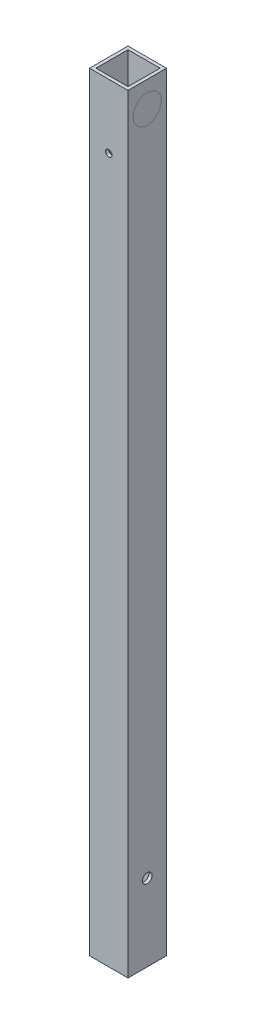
ISO-10303-21;
HEADER;
FILE_DESCRIPTION(('STEP AP214'),'2;1');
FILE_NAME('part.step','',(''),(''),'','','');
FILE_SCHEMA(('AUTOMOTIVE_DESIGN { 1 0 10303 214 1 1 1 1 }'));
ENDSEC;
DATA;
#1=APPLICATION_CONTEXT('core data for automotive mechanical design processes');
#2=APPLICATION_PROTOCOL_DEFINITION('international standard','automotive_design',2000,#1);
#3=PRODUCT_CONTEXT('',#1,'mechanical');
#4=PRODUCT('Part','Part','',(#3));
#5=PRODUCT_RELATED_PRODUCT_CATEGORY('part','',(#4));
#6=PRODUCT_DEFINITION_FORMATION('','',#4);
#7=PRODUCT_DEFINITION_CONTEXT('part definition',#1,'design');
#8=PRODUCT_DEFINITION('design','',#6,#7);
#9=PRODUCT_DEFINITION_SHAPE('','',#8);
#10=(LENGTH_UNIT() NAMED_UNIT(*) SI_UNIT(.MILLI.,.METRE.));
#11=(NAMED_UNIT(*) PLANE_ANGLE_UNIT() SI_UNIT($,.RADIAN.));
#12=(NAMED_UNIT(*) SI_UNIT($,.STERADIAN.) SOLID_ANGLE_UNIT());
#13=UNCERTAINTY_MEASURE_WITH_UNIT(LENGTH_MEASURE(1.E-05),#10,'distance_accuracy_value','');
#14=(GEOMETRIC_REPRESENTATION_CONTEXT(3) GLOBAL_UNCERTAINTY_ASSIGNED_CONTEXT((#13)) GLOBAL_UNIT_ASSIGNED_CONTEXT((#10,
#11,#12)) REPRESENTATION_CONTEXT('',''));
#15=CARTESIAN_POINT('',(0.,0.,0.));
#16=DIRECTION('',(0.,0.,1.));
#17=DIRECTION('',(1.,0.,0.));
#18=AXIS2_PLACEMENT_3D('',#15,#16,#17);
#19=CARTESIAN_POINT('',(19.05,762.,19.05));
#20=DIRECTION('',(-1.,0.,0.));
#21=DIRECTION('',(0.,0.,1.));
#22=AXIS2_PLACEMENT_3D('',#19,#20,#21);
#23=PLANE('',#22);
#24=DIRECTION('',(0.,0.,-1.));
#25=VECTOR('',#24,1.);
#26=CARTESIAN_POINT('',(19.05,0.,19.05));
#27=LINE('',#26,#25);
#28=CARTESIAN_POINT('',(19.05,0.,19.05));
#29=VERTEX_POINT('',#28);
#30=CARTESIAN_POINT('',(19.05,0.,-19.05));
#31=VERTEX_POINT('',#30);
#32=EDGE_CURVE('E120',#29,#31,#27,.T.);
#33=ORIENTED_EDGE('',*,*,#32,.T.);
#34=DIRECTION('',(0.,-1.,0.));
#35=VECTOR('',#34,1.);
#36=CARTESIAN_POINT('',(19.05,762.,-19.05));
#37=LINE('',#36,#35);
#38=CARTESIAN_POINT('',(19.05,762.,-19.05));
#39=VERTEX_POINT('',#38);
#40=EDGE_CURVE('E47',#39,#31,#37,.T.);
#41=ORIENTED_EDGE('',*,*,#40,.F.);
#42=DIRECTION('',(0.,0.,-1.));
#43=VECTOR('',#42,1.);
#44=CARTESIAN_POINT('',(19.05,762.,19.05));
#45=LINE('',#44,#43);
#46=CARTESIAN_POINT('',(19.05,762.,19.05));
#47=VERTEX_POINT('',#46);
#48=EDGE_CURVE('E143',#47,#39,#45,.T.);
#49=ORIENTED_EDGE('',*,*,#48,.F.);
#50=DIRECTION('',(0.,-1.,0.));
#51=VECTOR('',#50,1.);
#52=CARTESIAN_POINT('',(19.05,762.,19.05));
#53=LINE('',#52,#51);
#54=EDGE_CURVE('E153',#47,#29,#53,.T.);
#55=ORIENTED_EDGE('',*,*,#54,.T.);
#56=EDGE_LOOP('',(#33,#41,#49,#55));
#57=FACE_BOUND('',#56,.T.);
#58=CARTESIAN_POINT('',(19.05,76.2,0.));
#59=DIRECTION('',(-1.,0.,0.));
#60=DIRECTION('',(0.,0.,1.));
#61=AXIS2_PLACEMENT_3D('',#58,#59,#60);
#62=CIRCLE('',#61,4.7625);
#63=CARTESIAN_POINT('',(19.05,76.2,4.7625));
#64=VERTEX_POINT('',#63);
#65=EDGE_CURVE('E173',#64,#64,#62,.T.);
#66=ORIENTED_EDGE('',*,*,#65,.T.);
#67=EDGE_LOOP('',(#66));
#68=FACE_BOUND('',#67,.T.);
#69=CARTESIAN_POINT('',(19.05,736.6,0.));
#70=DIRECTION('',(-1.,0.,0.));
#71=DIRECTION('',(0.,0.,1.));
#72=AXIS2_PLACEMENT_3D('',#69,#70,#71);
#73=CIRCLE('',#72,13.97);
#74=CARTESIAN_POINT('',(19.05,736.6,13.97));
#75=VERTEX_POINT('',#74);
#76=EDGE_CURVE('E11',#75,#75,#73,.F.);
#77=ORIENTED_EDGE('',*,*,#76,.F.);
#78=EDGE_LOOP('',(#77));
#79=FACE_BOUND('',#78,.T.);
#80=ADVANCED_FACE('F37',(#57,#68,#79),#23,.F.);
#81=CARTESIAN_POINT('',(0.,762.,0.));
#82=DIRECTION('',(0.,-1.,0.));
#83=DIRECTION('',(0.,0.,-1.));
#84=AXIS2_PLACEMENT_3D('',#81,#82,#83);
#85=PLANE('',#84);
#86=ORIENTED_EDGE('',*,*,#48,.T.);
#87=DIRECTION('',(-1.,0.,0.));
#88=VECTOR('',#87,1.);
#89=CARTESIAN_POINT('',(-19.05,762.,-19.05));
#90=LINE('',#89,#88);
#91=CARTESIAN_POINT('',(-19.05,762.,-19.05));
#92=VERTEX_POINT('',#91);
#93=EDGE_CURVE('E146',#39,#92,#90,.T.);
#94=ORIENTED_EDGE('',*,*,#93,.T.);
#95=DIRECTION('',(0.,0.,1.));
#96=VECTOR('',#95,1.);
#97=CARTESIAN_POINT('',(-19.05,762.,19.05));
#98=LINE('',#97,#96);
#99=CARTESIAN_POINT('',(-19.05,762.,19.05));
#100=VERTEX_POINT('',#99);
#101=EDGE_CURVE('E149',#92,#100,#98,.T.);
#102=ORIENTED_EDGE('',*,*,#101,.T.);
#103=DIRECTION('',(1.,0.,0.));
#104=VECTOR('',#103,1.);
#105=CARTESIAN_POINT('',(-19.05,762.,19.05));
#106=LINE('',#105,#104);
#107=EDGE_CURVE('E151',#100,#47,#106,.T.);
#108=ORIENTED_EDGE('',*,*,#107,.T.);
#109=EDGE_LOOP('',(#86,#94,#102,#108));
#110=FACE_BOUND('',#109,.T.);
#111=DIRECTION('',(0.,0.,-1.));
#112=VECTOR('',#111,1.);
#113=CARTESIAN_POINT('',(15.875,762.,15.875));
#114=LINE('',#113,#112);
#115=CARTESIAN_POINT('',(15.875,762.,15.875));
#116=VERTEX_POINT('',#115);
#117=CARTESIAN_POINT('',(15.875,762.,-15.875));
#118=VERTEX_POINT('',#117);
#119=EDGE_CURVE('E104',#116,#118,#114,.T.);
#120=ORIENTED_EDGE('',*,*,#119,.F.);
#121=DIRECTION('',(1.,0.,0.));
#122=VECTOR('',#121,1.);
#123=CARTESIAN_POINT('',(-15.875,762.,15.875));
#124=LINE('',#123,#122);
#125=CARTESIAN_POINT('',(-15.875,762.,15.875));
#126=VERTEX_POINT('',#125);
#127=EDGE_CURVE('E127',#126,#116,#124,.T.);
#128=ORIENTED_EDGE('',*,*,#127,.F.);
#129=DIRECTION('',(0.,0.,1.));
#130=VECTOR('',#129,1.);
#131=CARTESIAN_POINT('',(-15.875,762.,15.875));
#132=LINE('',#131,#130);
#133=CARTESIAN_POINT('',(-15.875,762.,-15.875));
#134=VERTEX_POINT('',#133);
#135=EDGE_CURVE('E125',#134,#126,#132,.T.);
#136=ORIENTED_EDGE('',*,*,#135,.F.);
#137=DIRECTION('',(-1.,0.,0.));
#138=VECTOR('',#137,1.);
#139=CARTESIAN_POINT('',(-15.875,762.,-15.875));
#140=LINE('',#139,#138);
#141=EDGE_CURVE('E112',#118,#134,#140,.T.);
#142=ORIENTED_EDGE('',*,*,#141,.F.);
#143=EDGE_LOOP('',(#120,#128,#136,#142));
#144=FACE_BOUND('',#143,.T.);
#145=ADVANCED_FACE('F124',(#110,#144),#85,.F.);
#146=CARTESIAN_POINT('',(0.,0.,0.));
#147=DIRECTION('',(0.,-1.,0.));
#148=DIRECTION('',(0.,0.,-1.));
#149=AXIS2_PLACEMENT_3D('',#146,#147,#148);
#150=PLANE('',#149);
#151=ORIENTED_EDGE('',*,*,#32,.F.);
#152=DIRECTION('',(1.,0.,0.));
#153=VECTOR('',#152,1.);
#154=CARTESIAN_POINT('',(-19.05,0.,19.05));
#155=LINE('',#154,#153);
#156=CARTESIAN_POINT('',(-19.05,0.,19.05));
#157=VERTEX_POINT('',#156);
#158=EDGE_CURVE('E147',#157,#29,#155,.T.);
#159=ORIENTED_EDGE('',*,*,#158,.F.);
#160=DIRECTION('',(0.,0.,1.));
#161=VECTOR('',#160,1.);
#162=CARTESIAN_POINT('',(-19.05,0.,19.05));
#163=LINE('',#162,#161);
#164=CARTESIAN_POINT('',(-19.05,0.,-19.05));
#165=VERTEX_POINT('',#164);
#166=EDGE_CURVE('E158',#165,#157,#163,.T.);
#167=ORIENTED_EDGE('',*,*,#166,.F.);
#168=DIRECTION('',(-1.,0.,0.));
#169=VECTOR('',#168,1.);
#170=CARTESIAN_POINT('',(-19.05,0.,-19.05));
#171=LINE('',#170,#169);
#172=EDGE_CURVE('E156',#31,#165,#171,.T.);
#173=ORIENTED_EDGE('',*,*,#172,.F.);
#174=EDGE_LOOP('',(#151,#159,#167,#173));
#175=FACE_BOUND('',#174,.T.);
#176=DIRECTION('',(1.,0.,0.));
#177=VECTOR('',#176,1.);
#178=CARTESIAN_POINT('',(-15.875,0.,15.875));
#179=LINE('',#178,#177);
#180=CARTESIAN_POINT('',(-15.875,0.,15.875));
#181=VERTEX_POINT('',#180);
#182=CARTESIAN_POINT('',(15.875,0.,15.875));
#183=VERTEX_POINT('',#182);
#184=EDGE_CURVE('E113',#181,#183,#179,.T.);
#185=ORIENTED_EDGE('',*,*,#184,.T.);
#186=DIRECTION('',(0.,0.,-1.));
#187=VECTOR('',#186,1.);
#188=CARTESIAN_POINT('',(15.875,0.,15.875));
#189=LINE('',#188,#187);
#190=CARTESIAN_POINT('',(15.875,0.,-15.875));
#191=VERTEX_POINT('',#190);
#192=EDGE_CURVE('E62',#183,#191,#189,.T.);
#193=ORIENTED_EDGE('',*,*,#192,.T.);
#194=DIRECTION('',(-1.,0.,0.));
#195=VECTOR('',#194,1.);
#196=CARTESIAN_POINT('',(-15.875,0.,-15.875));
#197=LINE('',#196,#195);
#198=CARTESIAN_POINT('',(-15.875,0.,-15.875));
#199=VERTEX_POINT('',#198);
#200=EDGE_CURVE('E119',#191,#199,#197,.T.);
#201=ORIENTED_EDGE('',*,*,#200,.T.);
#202=DIRECTION('',(0.,0.,1.));
#203=VECTOR('',#202,1.);
#204=CARTESIAN_POINT('',(-15.875,0.,15.875));
#205=LINE('',#204,#203);
#206=EDGE_CURVE('E135',#199,#181,#205,.T.);
#207=ORIENTED_EDGE('',*,*,#206,.T.);
#208=EDGE_LOOP('',(#185,#193,#201,#207));
#209=FACE_BOUND('',#208,.T.);
#210=ADVANCED_FACE('F208',(#175,#209),#150,.T.);
#211=ORIENTED_EDGE('',*,*,#76,.T.);
#212=EDGE_LOOP('',(#211));
#213=FACE_BOUND('',#212,.T.);
#214=ADVANCED_FACE('F39',(#213),#23,.F.);
#215=CARTESIAN_POINT('',(-19.05,762.,-19.05));
#216=DIRECTION('',(0.,0.,1.));
#217=DIRECTION('',(1.,0.,0.));
#218=AXIS2_PLACEMENT_3D('',#215,#216,#217);
#219=PLANE('',#218);
#220=CARTESIAN_POINT('',(0.,698.5,-19.05));
#221=DIRECTION('',(0.,0.,-1.));
#222=DIRECTION('',(-1.,0.,0.));
#223=AXIS2_PLACEMENT_3D('',#220,#221,#222);
#224=CIRCLE('',#223,3.175);
#225=CARTESIAN_POINT('',(-3.175,698.5,-19.05));
#226=VERTEX_POINT('',#225);
#227=EDGE_CURVE('E188',#226,#226,#224,.T.);
#228=ORIENTED_EDGE('',*,*,#227,.F.);
#229=EDGE_LOOP('',(#228));
#230=FACE_BOUND('',#229,.T.);
#231=ORIENTED_EDGE('',*,*,#172,.T.);
#232=DIRECTION('',(0.,-1.,0.));
#233=VECTOR('',#232,1.);
#234=CARTESIAN_POINT('',(-19.05,762.,-19.05));
#235=LINE('',#234,#233);
#236=EDGE_CURVE('E166',#92,#165,#235,.T.);
#237=ORIENTED_EDGE('',*,*,#236,.F.);
#238=ORIENTED_EDGE('',*,*,#93,.F.);
#239=ORIENTED_EDGE('',*,*,#40,.T.);
#240=EDGE_LOOP('',(#231,#237,#238,#239));
#241=FACE_BOUND('',#240,.T.);
#242=ADVANCED_FACE('F229',(#230,#241),#219,.F.);
#243=CARTESIAN_POINT('',(-19.05,762.,19.05));
#244=DIRECTION('',(1.,0.,0.));
#245=DIRECTION('',(0.,0.,-1.));
#246=AXIS2_PLACEMENT_3D('',#243,#244,#245);
#247=PLANE('',#246);
#248=CARTESIAN_POINT('',(-19.05,76.2,0.));
#249=DIRECTION('',(-1.,0.,0.));
#250=DIRECTION('',(0.,0.,1.));
#251=AXIS2_PLACEMENT_3D('',#248,#249,#250);
#252=CIRCLE('',#251,4.7625);
#253=CARTESIAN_POINT('',(-19.05,76.2,4.7625));
#254=VERTEX_POINT('',#253);
#255=EDGE_CURVE('E178',#254,#254,#252,.T.);
#256=ORIENTED_EDGE('',*,*,#255,.F.);
#257=EDGE_LOOP('',(#256));
#258=FACE_BOUND('',#257,.T.);
#259=ORIENTED_EDGE('',*,*,#166,.T.);
#260=DIRECTION('',(0.,-1.,0.));
#261=VECTOR('',#260,1.);
#262=CARTESIAN_POINT('',(-19.05,762.,19.05));
#263=LINE('',#262,#261);
#264=EDGE_CURVE('E163',#100,#157,#263,.T.);
#265=ORIENTED_EDGE('',*,*,#264,.F.);
#266=ORIENTED_EDGE('',*,*,#101,.F.);
#267=ORIENTED_EDGE('',*,*,#236,.T.);
#268=EDGE_LOOP('',(#259,#265,#266,#267));
#269=FACE_BOUND('',#268,.T.);
#270=ADVANCED_FACE('F234',(#258,#269),#247,.F.);
#271=CARTESIAN_POINT('',(-19.05,762.,19.05));
#272=DIRECTION('',(0.,0.,-1.));
#273=DIRECTION('',(-1.,0.,0.));
#274=AXIS2_PLACEMENT_3D('',#271,#272,#273);
#275=PLANE('',#274);
#276=CARTESIAN_POINT('',(0.,698.5,19.05));
#277=DIRECTION('',(0.,0.,-1.));
#278=DIRECTION('',(-1.,0.,0.));
#279=AXIS2_PLACEMENT_3D('',#276,#277,#278);
#280=CIRCLE('',#279,3.175);
#281=CARTESIAN_POINT('',(-3.175,698.5,19.05));
#282=VERTEX_POINT('',#281);
#283=EDGE_CURVE('E191',#282,#282,#280,.T.);
#284=ORIENTED_EDGE('',*,*,#283,.T.);
#285=EDGE_LOOP('',(#284));
#286=FACE_BOUND('',#285,.T.);
#287=ORIENTED_EDGE('',*,*,#158,.T.);
#288=ORIENTED_EDGE('',*,*,#54,.F.);
#289=ORIENTED_EDGE('',*,*,#107,.F.);
#290=ORIENTED_EDGE('',*,*,#264,.T.);
#291=EDGE_LOOP('',(#287,#288,#289,#290));
#292=FACE_BOUND('',#291,.T.);
#293=ADVANCED_FACE('F247',(#286,#292),#275,.F.);
#294=CARTESIAN_POINT('',(15.875,762.,15.875));
#295=DIRECTION('',(-1.,0.,0.));
#296=DIRECTION('',(0.,0.,1.));
#297=AXIS2_PLACEMENT_3D('',#294,#295,#296);
#298=PLANE('',#297);
#299=CARTESIAN_POINT('',(15.875,76.2,0.));
#300=DIRECTION('',(-1.,0.,0.));
#301=DIRECTION('',(0.,0.,1.));
#302=AXIS2_PLACEMENT_3D('',#299,#300,#301);
#303=CIRCLE('',#302,4.7625);
#304=CARTESIAN_POINT('',(15.875,76.2,4.7625));
#305=VERTEX_POINT('',#304);
#306=EDGE_CURVE('E133',#305,#305,#303,.T.);
#307=ORIENTED_EDGE('',*,*,#306,.F.);
#308=EDGE_LOOP('',(#307));
#309=FACE_BOUND('',#308,.T.);
#310=ORIENTED_EDGE('',*,*,#192,.F.);
#311=DIRECTION('',(0.,-1.,0.));
#312=VECTOR('',#311,1.);
#313=CARTESIAN_POINT('',(15.875,762.,15.875));
#314=LINE('',#313,#312);
#315=EDGE_CURVE('E108',#116,#183,#314,.T.);
#316=ORIENTED_EDGE('',*,*,#315,.F.);
#317=ORIENTED_EDGE('',*,*,#119,.T.);
#318=DIRECTION('',(0.,-1.,0.));
#319=VECTOR('',#318,1.);
#320=CARTESIAN_POINT('',(15.875,762.,-15.875));
#321=LINE('',#320,#319);
#322=EDGE_CURVE('E107',#118,#191,#321,.T.);
#323=ORIENTED_EDGE('',*,*,#322,.T.);
#324=EDGE_LOOP('',(#310,#316,#317,#323));
#325=FACE_BOUND('',#324,.T.);
#326=ADVANCED_FACE('F106',(#309,#325),#298,.T.);
#327=CARTESIAN_POINT('',(-15.875,762.,-15.875));
#328=DIRECTION('',(0.,0.,1.));
#329=DIRECTION('',(1.,0.,0.));
#330=AXIS2_PLACEMENT_3D('',#327,#328,#329);
#331=PLANE('',#330);
#332=CARTESIAN_POINT('',(0.,698.5,-15.875));
#333=DIRECTION('',(0.,0.,1.));
#334=DIRECTION('',(1.,0.,0.));
#335=AXIS2_PLACEMENT_3D('',#332,#333,#334);
#336=CIRCLE('',#335,3.175);
#337=CARTESIAN_POINT('',(-3.175,698.5,-15.875));
#338=VERTEX_POINT('',#337);
#339=EDGE_CURVE('E183',#338,#338,#336,.T.);
#340=ORIENTED_EDGE('',*,*,#339,.F.);
#341=EDGE_LOOP('',(#340));
#342=FACE_BOUND('',#341,.T.);
#343=ORIENTED_EDGE('',*,*,#200,.F.);
#344=ORIENTED_EDGE('',*,*,#322,.F.);
#345=ORIENTED_EDGE('',*,*,#141,.T.);
#346=DIRECTION('',(0.,-1.,0.));
#347=VECTOR('',#346,1.);
#348=CARTESIAN_POINT('',(-15.875,762.,-15.875));
#349=LINE('',#348,#347);
#350=EDGE_CURVE('E121',#134,#199,#349,.T.);
#351=ORIENTED_EDGE('',*,*,#350,.T.);
#352=EDGE_LOOP('',(#343,#344,#345,#351));
#353=FACE_BOUND('',#352,.T.);
#354=ADVANCED_FACE('F116',(#342,#353),#331,.T.);
#355=CARTESIAN_POINT('',(-15.875,762.,15.875));
#356=DIRECTION('',(1.,0.,0.));
#357=DIRECTION('',(0.,0.,-1.));
#358=AXIS2_PLACEMENT_3D('',#355,#356,#357);
#359=PLANE('',#358);
#360=CARTESIAN_POINT('',(-15.875,76.2,0.));
#361=DIRECTION('',(1.,0.,0.));
#362=DIRECTION('',(0.,0.,-1.));
#363=AXIS2_PLACEMENT_3D('',#360,#361,#362);
#364=CIRCLE('',#363,4.7625);
#365=CARTESIAN_POINT('',(-15.875,76.2,4.7625));
#366=VERTEX_POINT('',#365);
#367=EDGE_CURVE('E171',#366,#366,#364,.T.);
#368=ORIENTED_EDGE('',*,*,#367,.F.);
#369=EDGE_LOOP('',(#368));
#370=FACE_BOUND('',#369,.T.);
#371=ORIENTED_EDGE('',*,*,#206,.F.);
#372=ORIENTED_EDGE('',*,*,#350,.F.);
#373=ORIENTED_EDGE('',*,*,#135,.T.);
#374=DIRECTION('',(0.,-1.,0.));
#375=VECTOR('',#374,1.);
#376=CARTESIAN_POINT('',(-15.875,762.,15.875));
#377=LINE('',#376,#375);
#378=EDGE_CURVE('E54',#126,#181,#377,.T.);
#379=ORIENTED_EDGE('',*,*,#378,.T.);
#380=EDGE_LOOP('',(#371,#372,#373,#379));
#381=FACE_BOUND('',#380,.T.);
#382=ADVANCED_FACE('F204',(#370,#381),#359,.T.);
#383=CARTESIAN_POINT('',(-15.875,762.,15.875));
#384=DIRECTION('',(0.,0.,-1.));
#385=DIRECTION('',(-1.,0.,0.));
#386=AXIS2_PLACEMENT_3D('',#383,#384,#385);
#387=PLANE('',#386);
#388=CARTESIAN_POINT('',(0.,698.5,15.875));
#389=DIRECTION('',(0.,0.,-1.));
#390=DIRECTION('',(-1.,0.,0.));
#391=AXIS2_PLACEMENT_3D('',#388,#389,#390);
#392=CIRCLE('',#391,3.175);
#393=CARTESIAN_POINT('',(-3.175,698.5,15.875));
#394=VERTEX_POINT('',#393);
#395=EDGE_CURVE('E41',#394,#394,#392,.T.);
#396=ORIENTED_EDGE('',*,*,#395,.F.);
#397=EDGE_LOOP('',(#396));
#398=FACE_BOUND('',#397,.T.);
#399=ORIENTED_EDGE('',*,*,#184,.F.);
#400=ORIENTED_EDGE('',*,*,#378,.F.);
#401=ORIENTED_EDGE('',*,*,#127,.T.);
#402=ORIENTED_EDGE('',*,*,#315,.T.);
#403=EDGE_LOOP('',(#399,#400,#401,#402));
#404=FACE_BOUND('',#403,.T.);
#405=ADVANCED_FACE('F201',(#398,#404),#387,.T.);
#406=CARTESIAN_POINT('',(19.05,76.2,0.));
#407=DIRECTION('',(-1.,0.,0.));
#408=DIRECTION('',(0.,0.,1.));
#409=AXIS2_PLACEMENT_3D('',#406,#407,#408);
#410=CYLINDRICAL_SURFACE('',#409,4.7625);
#411=CARTESIAN_POINT('',(-15.875,76.2,4.7625));
#412=CARTESIAN_POINT('',(-15.9080729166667,76.2,4.7625));
#413=CARTESIAN_POINT('',(-15.9411458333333,76.2,4.7625));
#414=CARTESIAN_POINT('',(-16.0072916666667,76.2,4.7625));
#415=CARTESIAN_POINT('',(-16.0403645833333,76.2,4.7625));
#416=CARTESIAN_POINT('',(-16.1065104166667,76.2,4.7625));
#417=CARTESIAN_POINT('',(-16.1395833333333,76.2,4.7625));
#418=CARTESIAN_POINT('',(-16.2057291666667,76.2,4.7625));
#419=CARTESIAN_POINT('',(-16.2388020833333,76.2,4.7625));
#420=CARTESIAN_POINT('',(-16.3049479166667,76.2,4.7625));
#421=CARTESIAN_POINT('',(-16.3380208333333,76.2,4.7625));
#422=CARTESIAN_POINT('',(-16.4041666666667,76.2,4.7625));
#423=CARTESIAN_POINT('',(-16.4372395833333,76.2,4.7625));
#424=CARTESIAN_POINT('',(-16.5033854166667,76.2,4.7625));
#425=CARTESIAN_POINT('',(-16.5364583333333,76.2,4.7625));
#426=CARTESIAN_POINT('',(-16.6026041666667,76.2,4.7625));
#427=CARTESIAN_POINT('',(-16.6356770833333,76.2,4.7625));
#428=CARTESIAN_POINT('',(-16.7018229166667,76.2,4.7625));
#429=CARTESIAN_POINT('',(-16.7348958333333,76.2,4.7625));
#430=CARTESIAN_POINT('',(-16.8010416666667,76.2,4.7625));
#431=CARTESIAN_POINT('',(-16.8341145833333,76.2,4.7625));
#432=CARTESIAN_POINT('',(-16.9002604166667,76.2,4.7625));
#433=CARTESIAN_POINT('',(-16.9333333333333,76.2,4.7625));
#434=CARTESIAN_POINT('',(-16.9994791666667,76.2,4.7625));
#435=CARTESIAN_POINT('',(-17.0325520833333,76.2,4.7625));
#436=CARTESIAN_POINT('',(-17.0986979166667,76.2,4.7625));
#437=CARTESIAN_POINT('',(-17.1317708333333,76.2,4.7625));
#438=CARTESIAN_POINT('',(-17.1979166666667,76.2,4.7625));
#439=CARTESIAN_POINT('',(-17.2309895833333,76.2,4.7625));
#440=CARTESIAN_POINT('',(-17.2971354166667,76.2,4.7625));
#441=CARTESIAN_POINT('',(-17.3302083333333,76.2,4.7625));
#442=CARTESIAN_POINT('',(-17.3963541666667,76.2,4.7625));
#443=CARTESIAN_POINT('',(-17.4294270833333,76.2,4.7625));
#444=CARTESIAN_POINT('',(-17.4955729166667,76.2,4.7625));
#445=CARTESIAN_POINT('',(-17.5286458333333,76.2,4.7625));
#446=CARTESIAN_POINT('',(-17.5947916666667,76.2,4.7625));
#447=CARTESIAN_POINT('',(-17.6278645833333,76.2,4.7625));
#448=CARTESIAN_POINT('',(-17.6940104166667,76.2,4.7625));
#449=CARTESIAN_POINT('',(-17.7270833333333,76.2,4.7625));
#450=CARTESIAN_POINT('',(-17.7932291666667,76.2,4.7625));
#451=CARTESIAN_POINT('',(-17.8263020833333,76.2,4.7625));
#452=CARTESIAN_POINT('',(-17.8924479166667,76.2,4.7625));
#453=CARTESIAN_POINT('',(-17.9255208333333,76.2,4.7625));
#454=CARTESIAN_POINT('',(-17.9916666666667,76.2,4.7625));
#455=CARTESIAN_POINT('',(-18.0247395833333,76.2,4.7625));
#456=CARTESIAN_POINT('',(-18.0908854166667,76.2,4.7625));
#457=CARTESIAN_POINT('',(-18.1239583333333,76.2,4.7625));
#458=CARTESIAN_POINT('',(-18.1901041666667,76.2,4.7625));
#459=CARTESIAN_POINT('',(-18.2231770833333,76.2,4.7625));
#460=CARTESIAN_POINT('',(-18.2893229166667,76.2,4.7625));
#461=CARTESIAN_POINT('',(-18.3223958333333,76.2,4.7625));
#462=CARTESIAN_POINT('',(-18.3885416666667,76.2,4.7625));
#463=CARTESIAN_POINT('',(-18.4216145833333,76.2,4.7625));
#464=CARTESIAN_POINT('',(-18.4877604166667,76.2,4.7625));
#465=CARTESIAN_POINT('',(-18.5208333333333,76.2,4.7625));
#466=CARTESIAN_POINT('',(-18.5869791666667,76.2,4.7625));
#467=CARTESIAN_POINT('',(-18.6200520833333,76.2,4.7625));
#468=CARTESIAN_POINT('',(-18.6861979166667,76.2,4.7625));
#469=CARTESIAN_POINT('',(-18.7192708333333,76.2,4.7625));
#470=CARTESIAN_POINT('',(-18.7854166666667,76.2,4.7625));
#471=CARTESIAN_POINT('',(-18.8184895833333,76.2,4.7625));
#472=CARTESIAN_POINT('',(-18.8846354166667,76.2,4.7625));
#473=CARTESIAN_POINT('',(-18.9177083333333,76.2,4.7625));
#474=CARTESIAN_POINT('',(-18.9838541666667,76.2,4.7625));
#475=CARTESIAN_POINT('',(-19.0169270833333,76.2,4.7625));
#476=CARTESIAN_POINT('',(-19.05,76.2,4.7625));
#477=B_SPLINE_CURVE_WITH_KNOTS('',3,(#411,#412,#413,#414,#415,#416,#417,#418,#419,#420,#421,
#422,#423,#424,#425,#426,#427,#428,#429,#430,#431,#432,#433,#434,#435,#436,#437,#438,#439,#440,
#441,#442,#443,#444,#445,#446,#447,#448,#449,#450,#451,#452,#453,#454,#455,#456,#457,#458,#459,
#460,#461,#462,#463,#464,#465,#466,#467,#468,#469,#470,#471,#472,#473,#474,#475,#476),
.UNSPECIFIED.,.F.,.F.,(4,2,2,2,2,2,2,2,2,2,2,2,2,2,2,2,2,2,2,2,2,2,2,2,2,2,2,2,2,2,2,2,4),(0.,
0.0992187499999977,0.198437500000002,0.29765625,0.396874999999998,0.496093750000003,0.5953125,
0.694531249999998,0.793749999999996,0.892968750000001,0.992187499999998,1.09140625,1.190625,
1.28984375,1.3890625,1.48828125,1.5875,1.68671875,1.7859375,1.88515625,1.984375,2.08359375,
2.1828125,2.28203125,2.38125,2.48046875,2.5796875,2.67890624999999,2.778125,2.87734375,
2.97656249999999,3.07578125,3.175),.UNSPECIFIED.);
#478=EDGE_CURVE('BSEAM203',#366,#254,#477,.T.);
#479=ORIENTED_EDGE('',*,*,#367,.T.);
#480=ORIENTED_EDGE('',*,*,#255,.T.);
#481=ORIENTED_EDGE('',*,*,#478,.T.);
#482=ORIENTED_EDGE('',*,*,#478,.F.);
#483=EDGE_LOOP('',(#479,#481,#480,#482));
#484=FACE_BOUND('',#483,.T.);
#485=ADVANCED_FACE('F203',(#484),#410,.F.);
#486=CARTESIAN_POINT('',(15.875,76.2,4.7625));
#487=CARTESIAN_POINT('',(15.9080729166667,76.2,4.7625));
#488=CARTESIAN_POINT('',(15.9411458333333,76.2,4.7625));
#489=CARTESIAN_POINT('',(16.0072916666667,76.2,4.7625));
#490=CARTESIAN_POINT('',(16.0403645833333,76.2,4.7625));
#491=CARTESIAN_POINT('',(16.1065104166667,76.2,4.7625));
#492=CARTESIAN_POINT('',(16.1395833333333,76.2,4.7625));
#493=CARTESIAN_POINT('',(16.2057291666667,76.2,4.7625));
#494=CARTESIAN_POINT('',(16.2388020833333,76.2,4.7625));
#495=CARTESIAN_POINT('',(16.3049479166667,76.2,4.7625));
#496=CARTESIAN_POINT('',(16.3380208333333,76.2,4.7625));
#497=CARTESIAN_POINT('',(16.4041666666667,76.2,4.7625));
#498=CARTESIAN_POINT('',(16.4372395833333,76.2,4.7625));
#499=CARTESIAN_POINT('',(16.5033854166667,76.2,4.7625));
#500=CARTESIAN_POINT('',(16.5364583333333,76.2,4.7625));
#501=CARTESIAN_POINT('',(16.6026041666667,76.2,4.7625));
#502=CARTESIAN_POINT('',(16.6356770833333,76.2,4.7625));
#503=CARTESIAN_POINT('',(16.7018229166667,76.2,4.7625));
#504=CARTESIAN_POINT('',(16.7348958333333,76.2,4.7625));
#505=CARTESIAN_POINT('',(16.8010416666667,76.2,4.7625));
#506=CARTESIAN_POINT('',(16.8341145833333,76.2,4.7625));
#507=CARTESIAN_POINT('',(16.9002604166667,76.2,4.7625));
#508=CARTESIAN_POINT('',(16.9333333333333,76.2,4.7625));
#509=CARTESIAN_POINT('',(16.9994791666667,76.2,4.7625));
#510=CARTESIAN_POINT('',(17.0325520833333,76.2,4.7625));
#511=CARTESIAN_POINT('',(17.0986979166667,76.2,4.7625));
#512=CARTESIAN_POINT('',(17.1317708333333,76.2,4.7625));
#513=CARTESIAN_POINT('',(17.1979166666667,76.2,4.7625));
#514=CARTESIAN_POINT('',(17.2309895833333,76.2,4.7625));
#515=CARTESIAN_POINT('',(17.2971354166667,76.2,4.7625));
#516=CARTESIAN_POINT('',(17.3302083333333,76.2,4.7625));
#517=CARTESIAN_POINT('',(17.3963541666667,76.2,4.7625));
#518=CARTESIAN_POINT('',(17.4294270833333,76.2,4.7625));
#519=CARTESIAN_POINT('',(17.4955729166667,76.2,4.7625));
#520=CARTESIAN_POINT('',(17.5286458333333,76.2,4.7625));
#521=CARTESIAN_POINT('',(17.5947916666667,76.2,4.7625));
#522=CARTESIAN_POINT('',(17.6278645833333,76.2,4.7625));
#523=CARTESIAN_POINT('',(17.6940104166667,76.2,4.7625));
#524=CARTESIAN_POINT('',(17.7270833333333,76.2,4.7625));
#525=CARTESIAN_POINT('',(17.7932291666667,76.2,4.7625));
#526=CARTESIAN_POINT('',(17.8263020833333,76.2,4.7625));
#527=CARTESIAN_POINT('',(17.8924479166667,76.2,4.7625));
#528=CARTESIAN_POINT('',(17.9255208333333,76.2,4.7625));
#529=CARTESIAN_POINT('',(17.9916666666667,76.2,4.7625));
#530=CARTESIAN_POINT('',(18.0247395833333,76.2,4.7625));
#531=CARTESIAN_POINT('',(18.0908854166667,76.2,4.7625));
#532=CARTESIAN_POINT('',(18.1239583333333,76.2,4.7625));
#533=CARTESIAN_POINT('',(18.1901041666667,76.2,4.7625));
#534=CARTESIAN_POINT('',(18.2231770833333,76.2,4.7625));
#535=CARTESIAN_POINT('',(18.2893229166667,76.2,4.7625));
#536=CARTESIAN_POINT('',(18.3223958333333,76.2,4.7625));
#537=CARTESIAN_POINT('',(18.3885416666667,76.2,4.7625));
#538=CARTESIAN_POINT('',(18.4216145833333,76.2,4.7625));
#539=CARTESIAN_POINT('',(18.4877604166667,76.2,4.7625));
#540=CARTESIAN_POINT('',(18.5208333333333,76.2,4.7625));
#541=CARTESIAN_POINT('',(18.5869791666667,76.2,4.7625));
#542=CARTESIAN_POINT('',(18.6200520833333,76.2,4.7625));
#543=CARTESIAN_POINT('',(18.6861979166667,76.2,4.7625));
#544=CARTESIAN_POINT('',(18.7192708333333,76.2,4.7625));
#545=CARTESIAN_POINT('',(18.7854166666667,76.2,4.7625));
#546=CARTESIAN_POINT('',(18.8184895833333,76.2,4.7625));
#547=CARTESIAN_POINT('',(18.8846354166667,76.2,4.7625));
#548=CARTESIAN_POINT('',(18.9177083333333,76.2,4.7625));
#549=CARTESIAN_POINT('',(18.9838541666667,76.2,4.7625));
#550=CARTESIAN_POINT('',(19.0169270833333,76.2,4.7625));
#551=CARTESIAN_POINT('',(19.05,76.2,4.7625));
#552=B_SPLINE_CURVE_WITH_KNOTS('',3,(#486,#487,#488,#489,#490,#491,#492,#493,#494,#495,#496,
#497,#498,#499,#500,#501,#502,#503,#504,#505,#506,#507,#508,#509,#510,#511,#512,#513,#514,#515,
#516,#517,#518,#519,#520,#521,#522,#523,#524,#525,#526,#527,#528,#529,#530,#531,#532,#533,#534,
#535,#536,#537,#538,#539,#540,#541,#542,#543,#544,#545,#546,#547,#548,#549,#550,#551),
.UNSPECIFIED.,.F.,.F.,(4,2,2,2,2,2,2,2,2,2,2,2,2,2,2,2,2,2,2,2,2,2,2,2,2,2,2,2,2,2,2,2,4),(0.,
0.0992187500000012,0.198437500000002,0.297656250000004,0.396875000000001,0.496093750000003,
0.595312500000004,0.694531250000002,0.793750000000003,0.892968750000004,0.992187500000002,
1.09140625,1.190625,1.28984375,1.3890625,1.48828125,1.5875,1.68671875,1.7859375,1.88515625,
1.984375,2.08359375,2.18281250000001,2.28203125,2.38125,2.48046875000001,2.5796875,
2.67890625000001,2.77812500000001,2.87734375,2.97656250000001,3.07578125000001,3.175),.UNSPECIFIED.);
#553=EDGE_CURVE('BSEAM271',#305,#64,#552,.T.);
#554=ORIENTED_EDGE('',*,*,#306,.T.);
#555=ORIENTED_EDGE('',*,*,#65,.F.);
#556=ORIENTED_EDGE('',*,*,#553,.T.);
#557=ORIENTED_EDGE('',*,*,#553,.F.);
#558=EDGE_LOOP('',(#554,#556,#555,#557));
#559=FACE_BOUND('',#558,.T.);
#560=ADVANCED_FACE('F271',(#559),#410,.F.);
#561=CARTESIAN_POINT('',(0.,698.5,19.05));
#562=DIRECTION('',(0.,0.,-1.));
#563=DIRECTION('',(-1.,0.,0.));
#564=AXIS2_PLACEMENT_3D('',#561,#562,#563);
#565=CYLINDRICAL_SURFACE('',#564,3.175);
#566=CARTESIAN_POINT('',(-3.175,698.5,15.875));
#567=CARTESIAN_POINT('',(-3.175,698.5,15.9080729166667));
#568=CARTESIAN_POINT('',(-3.175,698.5,15.9411458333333));
#569=CARTESIAN_POINT('',(-3.175,698.5,16.0072916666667));
#570=CARTESIAN_POINT('',(-3.175,698.5,16.0403645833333));
#571=CARTESIAN_POINT('',(-3.175,698.5,16.1065104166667));
#572=CARTESIAN_POINT('',(-3.175,698.5,16.1395833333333));
#573=CARTESIAN_POINT('',(-3.175,698.5,16.2057291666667));
#574=CARTESIAN_POINT('',(-3.175,698.5,16.2388020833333));
#575=CARTESIAN_POINT('',(-3.175,698.5,16.3049479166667));
#576=CARTESIAN_POINT('',(-3.175,698.5,16.3380208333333));
#577=CARTESIAN_POINT('',(-3.175,698.5,16.4041666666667));
#578=CARTESIAN_POINT('',(-3.175,698.5,16.4372395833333));
#579=CARTESIAN_POINT('',(-3.175,698.5,16.5033854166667));
#580=CARTESIAN_POINT('',(-3.175,698.5,16.5364583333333));
#581=CARTESIAN_POINT('',(-3.175,698.5,16.6026041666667));
#582=CARTESIAN_POINT('',(-3.175,698.5,16.6356770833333));
#583=CARTESIAN_POINT('',(-3.175,698.5,16.7018229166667));
#584=CARTESIAN_POINT('',(-3.175,698.5,16.7348958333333));
#585=CARTESIAN_POINT('',(-3.175,698.5,16.8010416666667));
#586=CARTESIAN_POINT('',(-3.175,698.5,16.8341145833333));
#587=CARTESIAN_POINT('',(-3.175,698.5,16.9002604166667));
#588=CARTESIAN_POINT('',(-3.175,698.5,16.9333333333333));
#589=CARTESIAN_POINT('',(-3.175,698.5,16.9994791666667));
#590=CARTESIAN_POINT('',(-3.175,698.5,17.0325520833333));
#591=CARTESIAN_POINT('',(-3.175,698.5,17.0986979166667));
#592=CARTESIAN_POINT('',(-3.175,698.5,17.1317708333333));
#593=CARTESIAN_POINT('',(-3.175,698.5,17.1979166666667));
#594=CARTESIAN_POINT('',(-3.175,698.5,17.2309895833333));
#595=CARTESIAN_POINT('',(-3.175,698.5,17.2971354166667));
#596=CARTESIAN_POINT('',(-3.175,698.5,17.3302083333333));
#597=CARTESIAN_POINT('',(-3.175,698.5,17.3963541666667));
#598=CARTESIAN_POINT('',(-3.175,698.5,17.4294270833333));
#599=CARTESIAN_POINT('',(-3.175,698.5,17.4955729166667));
#600=CARTESIAN_POINT('',(-3.175,698.5,17.5286458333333));
#601=CARTESIAN_POINT('',(-3.175,698.5,17.5947916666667));
#602=CARTESIAN_POINT('',(-3.175,698.5,17.6278645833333));
#603=CARTESIAN_POINT('',(-3.175,698.5,17.6940104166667));
#604=CARTESIAN_POINT('',(-3.175,698.5,17.7270833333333));
#605=CARTESIAN_POINT('',(-3.175,698.5,17.7932291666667));
#606=CARTESIAN_POINT('',(-3.175,698.5,17.8263020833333));
#607=CARTESIAN_POINT('',(-3.175,698.5,17.8924479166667));
#608=CARTESIAN_POINT('',(-3.175,698.5,17.9255208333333));
#609=CARTESIAN_POINT('',(-3.175,698.5,17.9916666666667));
#610=CARTESIAN_POINT('',(-3.175,698.5,18.0247395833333));
#611=CARTESIAN_POINT('',(-3.175,698.5,18.0908854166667));
#612=CARTESIAN_POINT('',(-3.175,698.5,18.1239583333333));
#613=CARTESIAN_POINT('',(-3.175,698.5,18.1901041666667));
#614=CARTESIAN_POINT('',(-3.175,698.5,18.2231770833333));
#615=CARTESIAN_POINT('',(-3.175,698.5,18.2893229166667));
#616=CARTESIAN_POINT('',(-3.175,698.5,18.3223958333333));
#617=CARTESIAN_POINT('',(-3.175,698.5,18.3885416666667));
#618=CARTESIAN_POINT('',(-3.175,698.5,18.4216145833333));
#619=CARTESIAN_POINT('',(-3.175,698.5,18.4877604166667));
#620=CARTESIAN_POINT('',(-3.175,698.5,18.5208333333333));
#621=CARTESIAN_POINT('',(-3.175,698.5,18.5869791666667));
#622=CARTESIAN_POINT('',(-3.175,698.5,18.6200520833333));
#623=CARTESIAN_POINT('',(-3.175,698.5,18.6861979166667));
#624=CARTESIAN_POINT('',(-3.175,698.5,18.7192708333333));
#625=CARTESIAN_POINT('',(-3.175,698.5,18.7854166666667));
#626=CARTESIAN_POINT('',(-3.175,698.5,18.8184895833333));
#627=CARTESIAN_POINT('',(-3.175,698.5,18.8846354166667));
#628=CARTESIAN_POINT('',(-3.175,698.5,18.9177083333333));
#629=CARTESIAN_POINT('',(-3.175,698.5,18.9838541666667));
#630=CARTESIAN_POINT('',(-3.175,698.5,19.0169270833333));
#631=CARTESIAN_POINT('',(-3.175,698.5,19.05));
#632=B_SPLINE_CURVE_WITH_KNOTS('',3,(#566,#567,#568,#569,#570,#571,#572,#573,#574,#575,#576,
#577,#578,#579,#580,#581,#582,#583,#584,#585,#586,#587,#588,#589,#590,#591,#592,#593,#594,#595,
#596,#597,#598,#599,#600,#601,#602,#603,#604,#605,#606,#607,#608,#609,#610,#611,#612,#613,#614,
#615,#616,#617,#618,#619,#620,#621,#622,#623,#624,#625,#626,#627,#628,#629,#630,#631),
.UNSPECIFIED.,.F.,.F.,(4,2,2,2,2,2,2,2,2,2,2,2,2,2,2,2,2,2,2,2,2,2,2,2,2,2,2,2,2,2,2,2,4),(0.,
0.0992187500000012,0.198437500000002,0.29765625,0.396875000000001,0.496093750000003,0.5953125,
0.694531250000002,0.793750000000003,0.892968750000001,0.992187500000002,1.09140625,1.190625,
1.28984375,1.3890625,1.48828125,1.5875,1.68671875,1.7859375,1.88515625,1.984375,2.08359375,
2.1828125,2.28203125,2.38125,2.48046875,2.5796875,2.67890625,2.778125,2.87734375,2.9765625,
3.07578125,3.175),.UNSPECIFIED.);
#633=EDGE_CURVE('BSEAM198',#394,#282,#632,.T.);
#634=ORIENTED_EDGE('',*,*,#395,.T.);
#635=ORIENTED_EDGE('',*,*,#283,.F.);
#636=ORIENTED_EDGE('',*,*,#633,.T.);
#637=ORIENTED_EDGE('',*,*,#633,.F.);
#638=EDGE_LOOP('',(#634,#636,#635,#637));
#639=FACE_BOUND('',#638,.T.);
#640=ADVANCED_FACE('F198',(#639),#565,.F.);
#641=CARTESIAN_POINT('',(-3.175,698.5,-15.875));
#642=CARTESIAN_POINT('',(-3.175,698.5,-15.9080729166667));
#643=CARTESIAN_POINT('',(-3.175,698.5,-15.9411458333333));
#644=CARTESIAN_POINT('',(-3.175,698.5,-16.0072916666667));
#645=CARTESIAN_POINT('',(-3.175,698.5,-16.0403645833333));
#646=CARTESIAN_POINT('',(-3.175,698.5,-16.1065104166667));
#647=CARTESIAN_POINT('',(-3.175,698.5,-16.1395833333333));
#648=CARTESIAN_POINT('',(-3.175,698.5,-16.2057291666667));
#649=CARTESIAN_POINT('',(-3.175,698.5,-16.2388020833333));
#650=CARTESIAN_POINT('',(-3.175,698.5,-16.3049479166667));
#651=CARTESIAN_POINT('',(-3.175,698.5,-16.3380208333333));
#652=CARTESIAN_POINT('',(-3.175,698.5,-16.4041666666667));
#653=CARTESIAN_POINT('',(-3.175,698.5,-16.4372395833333));
#654=CARTESIAN_POINT('',(-3.175,698.5,-16.5033854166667));
#655=CARTESIAN_POINT('',(-3.175,698.5,-16.5364583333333));
#656=CARTESIAN_POINT('',(-3.175,698.5,-16.6026041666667));
#657=CARTESIAN_POINT('',(-3.175,698.5,-16.6356770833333));
#658=CARTESIAN_POINT('',(-3.175,698.5,-16.7018229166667));
#659=CARTESIAN_POINT('',(-3.175,698.5,-16.7348958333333));
#660=CARTESIAN_POINT('',(-3.175,698.5,-16.8010416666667));
#661=CARTESIAN_POINT('',(-3.175,698.5,-16.8341145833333));
#662=CARTESIAN_POINT('',(-3.175,698.5,-16.9002604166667));
#663=CARTESIAN_POINT('',(-3.175,698.5,-16.9333333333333));
#664=CARTESIAN_POINT('',(-3.175,698.5,-16.9994791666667));
#665=CARTESIAN_POINT('',(-3.175,698.5,-17.0325520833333));
#666=CARTESIAN_POINT('',(-3.175,698.5,-17.0986979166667));
#667=CARTESIAN_POINT('',(-3.175,698.5,-17.1317708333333));
#668=CARTESIAN_POINT('',(-3.175,698.5,-17.1979166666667));
#669=CARTESIAN_POINT('',(-3.175,698.5,-17.2309895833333));
#670=CARTESIAN_POINT('',(-3.175,698.5,-17.2971354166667));
#671=CARTESIAN_POINT('',(-3.175,698.5,-17.3302083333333));
#672=CARTESIAN_POINT('',(-3.175,698.5,-17.3963541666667));
#673=CARTESIAN_POINT('',(-3.175,698.5,-17.4294270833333));
#674=CARTESIAN_POINT('',(-3.175,698.5,-17.4955729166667));
#675=CARTESIAN_POINT('',(-3.175,698.5,-17.5286458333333));
#676=CARTESIAN_POINT('',(-3.175,698.5,-17.5947916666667));
#677=CARTESIAN_POINT('',(-3.175,698.5,-17.6278645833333));
#678=CARTESIAN_POINT('',(-3.175,698.5,-17.6940104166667));
#679=CARTESIAN_POINT('',(-3.175,698.5,-17.7270833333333));
#680=CARTESIAN_POINT('',(-3.175,698.5,-17.7932291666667));
#681=CARTESIAN_POINT('',(-3.175,698.5,-17.8263020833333));
#682=CARTESIAN_POINT('',(-3.175,698.5,-17.8924479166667));
#683=CARTESIAN_POINT('',(-3.175,698.5,-17.9255208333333));
#684=CARTESIAN_POINT('',(-3.175,698.5,-17.9916666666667));
#685=CARTESIAN_POINT('',(-3.175,698.5,-18.0247395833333));
#686=CARTESIAN_POINT('',(-3.175,698.5,-18.0908854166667));
#687=CARTESIAN_POINT('',(-3.175,698.5,-18.1239583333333));
#688=CARTESIAN_POINT('',(-3.175,698.5,-18.1901041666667));
#689=CARTESIAN_POINT('',(-3.175,698.5,-18.2231770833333));
#690=CARTESIAN_POINT('',(-3.175,698.5,-18.2893229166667));
#691=CARTESIAN_POINT('',(-3.175,698.5,-18.3223958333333));
#692=CARTESIAN_POINT('',(-3.175,698.5,-18.3885416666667));
#693=CARTESIAN_POINT('',(-3.175,698.5,-18.4216145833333));
#694=CARTESIAN_POINT('',(-3.175,698.5,-18.4877604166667));
#695=CARTESIAN_POINT('',(-3.175,698.5,-18.5208333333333));
#696=CARTESIAN_POINT('',(-3.175,698.5,-18.5869791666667));
#697=CARTESIAN_POINT('',(-3.175,698.5,-18.6200520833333));
#698=CARTESIAN_POINT('',(-3.175,698.5,-18.6861979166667));
#699=CARTESIAN_POINT('',(-3.175,698.5,-18.7192708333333));
#700=CARTESIAN_POINT('',(-3.175,698.5,-18.7854166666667));
#701=CARTESIAN_POINT('',(-3.175,698.5,-18.8184895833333));
#702=CARTESIAN_POINT('',(-3.175,698.5,-18.8846354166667));
#703=CARTESIAN_POINT('',(-3.175,698.5,-18.9177083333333));
#704=CARTESIAN_POINT('',(-3.175,698.5,-18.9838541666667));
#705=CARTESIAN_POINT('',(-3.175,698.5,-19.0169270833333));
#706=CARTESIAN_POINT('',(-3.175,698.5,-19.05));
#707=B_SPLINE_CURVE_WITH_KNOTS('',3,(#641,#642,#643,#644,#645,#646,#647,#648,#649,#650,#651,
#652,#653,#654,#655,#656,#657,#658,#659,#660,#661,#662,#663,#664,#665,#666,#667,#668,#669,#670,
#671,#672,#673,#674,#675,#676,#677,#678,#679,#680,#681,#682,#683,#684,#685,#686,#687,#688,#689,
#690,#691,#692,#693,#694,#695,#696,#697,#698,#699,#700,#701,#702,#703,#704,#705,#706),
.UNSPECIFIED.,.F.,.F.,(4,2,2,2,2,2,2,2,2,2,2,2,2,2,2,2,2,2,2,2,2,2,2,2,2,2,2,2,2,2,2,2,4),(0.,
0.0992187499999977,0.198437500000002,0.29765625,0.396874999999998,0.496093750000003,0.5953125,
0.694531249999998,0.793749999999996,0.892968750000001,0.992187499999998,1.09140625,1.190625,
1.28984375,1.3890625,1.48828125,1.5875,1.68671875,1.7859375,1.88515625,1.984375,2.08359375,
2.1828125,2.28203125,2.38125,2.48046875,2.5796875,2.67890624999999,2.778125,2.87734375,
2.97656249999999,3.07578125,3.175),.UNSPECIFIED.);
#708=EDGE_CURVE('BSEAM279',#338,#226,#707,.T.);
#709=ORIENTED_EDGE('',*,*,#339,.T.);
#710=ORIENTED_EDGE('',*,*,#227,.T.);
#711=ORIENTED_EDGE('',*,*,#708,.T.);
#712=ORIENTED_EDGE('',*,*,#708,.F.);
#713=EDGE_LOOP('',(#709,#711,#710,#712));
#714=FACE_BOUND('',#713,.T.);
#715=ADVANCED_FACE('F279',(#714),#565,.F.);
#716=CLOSED_SHELL('',(#80,#145,#210,#214,#242,#270,#293,#326,#354,#382,#405,#485,#560,#640,#715));
#717=MANIFOLD_SOLID_BREP('B2',#716);
#718=ADVANCED_BREP_SHAPE_REPRESENTATION('',(#18,#717),#14);
#719=SHAPE_DEFINITION_REPRESENTATION(#9,#718);
ENDSEC;
END-ISO-10303-21;
